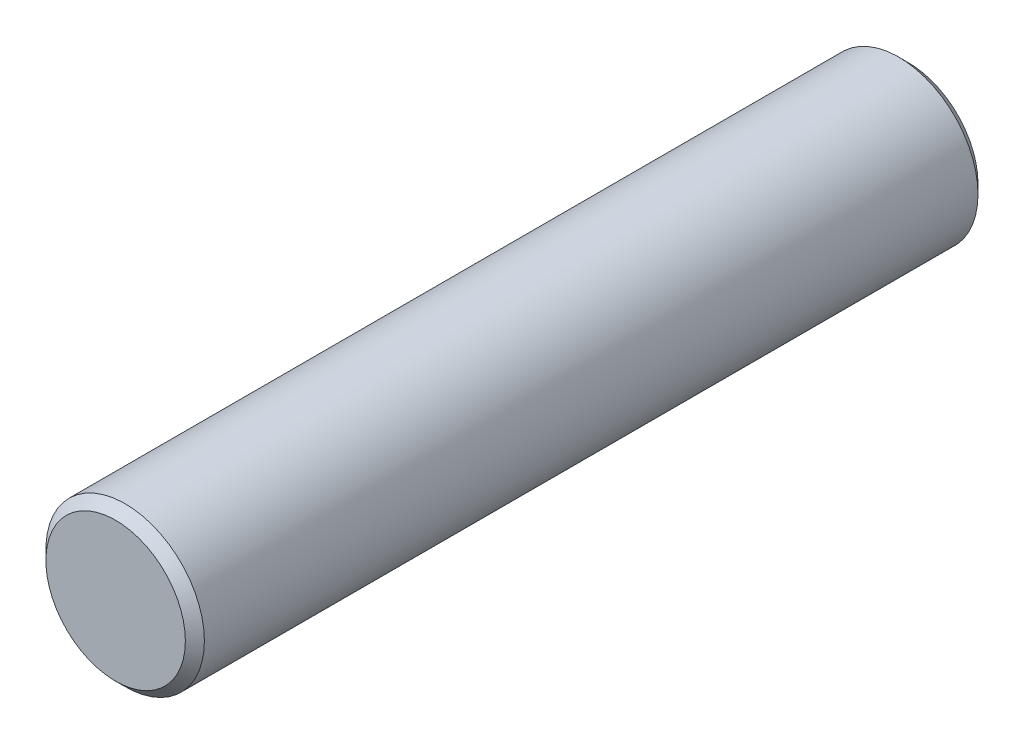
from build123d import *

# Parameters (mm, degrees)
ESQUISSE1_R      = 2.5
EXTRUSION1_DEPTH = 25
CHANFREIN1_SIZE  = 0.3


with BuildPart() as part:
    # Esquisse1 → Extrusion1 (new body)
    with BuildSketch(Plane.XY):
        with Locations((-31.033119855, 51.683694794)):
            Circle(ESQUISSE1_R)
    extrude(amount=-EXTRUSION1_DEPTH)

    # Chanfrein1
    chanfrein1_edges = [part.edges().sort_by_distance(p)[0] for p in [
        (-33.533119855, 51.683694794, 0),
        (-33.533119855, 51.683694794, -25),
    ]]
    chamfer(chanfrein1_edges, length=CHANFREIN1_SIZE)


solid = part.part
